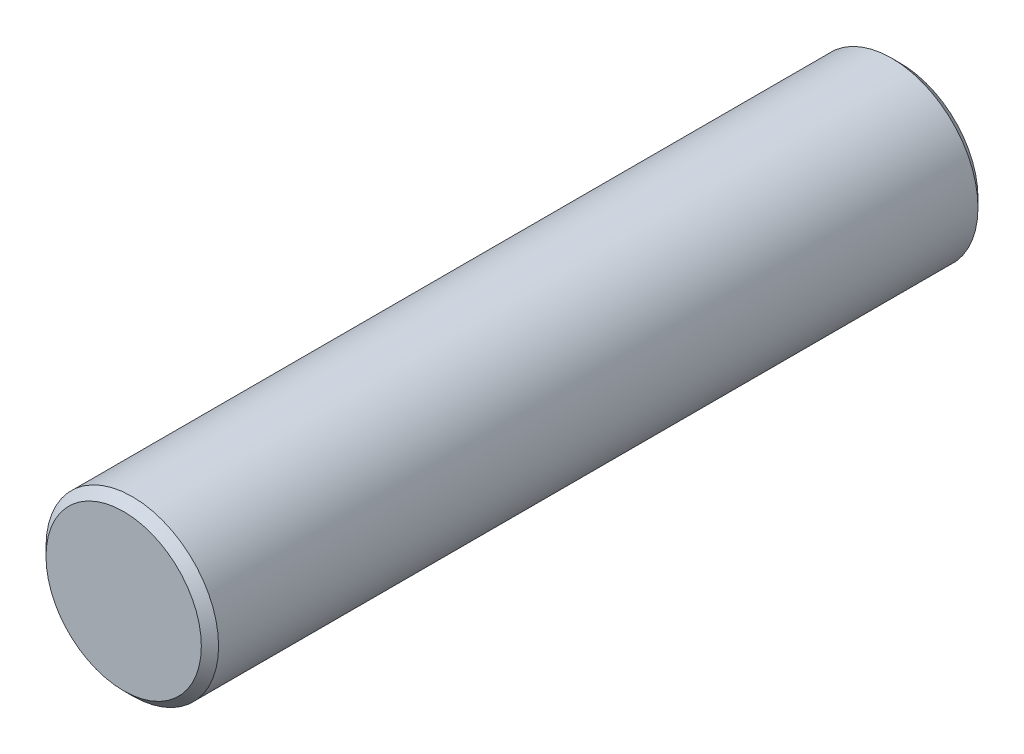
from build123d import *

# Parameters (mm, degrees)
CROQUIS1_R     = 5
EXTRUIR1_DEPTH = 45
CHAFL_N1_SIZE  = 0.5


with BuildPart() as part:
    # Croquis1 → Extruir1 (new body)
    with BuildSketch(Plane.XY):
        with Locations(Location((0, 0, 0), (0, 0, 180))):
            Circle(CROQUIS1_R)
    extrude(amount=EXTRUIR1_DEPTH)

    # Chafl_n1
    chafl_n1_edges = [part.edges().sort_by_distance(p)[0] for p in [
        (5, 0, 0),
        (5, 0, 45),
    ]]
    chamfer(chafl_n1_edges, length=CHAFL_N1_SIZE)


solid = part.part
